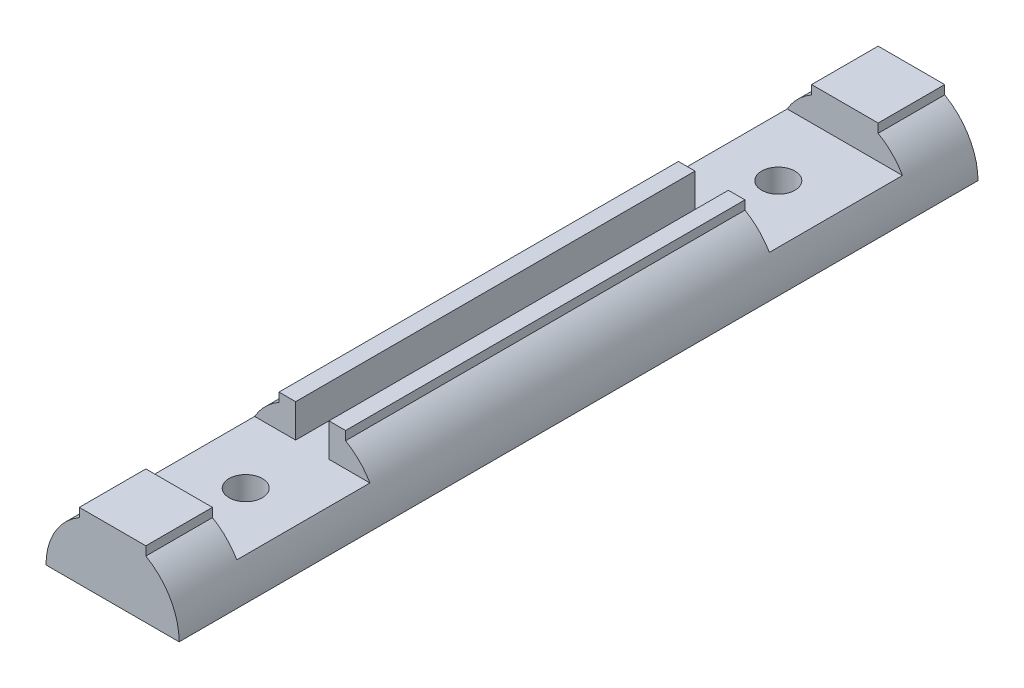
from build123d import *

# Parameters (mm, degrees)
SKETCH1_R           = 10
BOSS_EXTRUDE1_DEPTH = 60
SKETCH2_W           = 10
SKETCH2_H           = 20
BOSS_EXTRUDE2_DEPTH = 120
SKETCH3_W           = 17.320508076
SKETCH3_H           = 5
CUT_EXTRUDE1_DEPTH  = 10
SKETCH4_R           = 2.5
CUT_EXTRUDE3_DEPTH  = 63.649820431
SKETCH5_W           = 5
SKETCH5_H           = 60
CUT_EXTRUDE2_DEPTH  = 5
SKETCH6_W           = 20
SKETCH6_H           = 10
CUT_EXTRUDE4_DEPTH  = 121.830459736


with BuildPart() as part:
    # Sketch1 → Boss-Extrude1 (new, symmetric)
    with BuildSketch(Plane.XY):
        Circle(SKETCH1_R)
    extrude(amount=BOSS_EXTRUDE1_DEPTH, both=True)

    # Sketch2 → Boss-Extrude2 (add)
    with BuildSketch(Plane.XY.offset(60)):
        Rectangle(SKETCH2_W, SKETCH2_H)
    extrude(amount=-BOSS_EXTRUDE2_DEPTH)

    # Sketch3 → Cut-Extrude1 (cut, symmetric)
    with BuildSketch(Plane.XY.offset(-40)):
        with Locations((0, 7.5)):
            Rectangle(SKETCH3_W, SKETCH3_H)
    cut_extrude1 = extrude(amount=CUT_EXTRUDE1_DEPTH, both=True, mode=Mode.SUBTRACT)

    # Sketch4 → Cut-Extrude3 (cut, through all)
    with BuildSketch(Plane(origin=(0, 5, 0), x_dir=(1, 0, 0), z_dir=(0, 1, 0))):
        with Locations(Location((0, 40, 0), (0, 0, 270))):
            Circle(SKETCH4_R)
    cut_extrude3 = extrude(amount=-CUT_EXTRUDE3_DEPTH, mode=Mode.SUBTRACT)

    # Mirror1: Cut-Extrude1, Cut-Extrude3 across plane
    add(cut_extrude1.mirror(Plane.XY), mode=Mode.SUBTRACT)
    add(cut_extrude3.mirror(Plane.XY), mode=Mode.SUBTRACT)

    # Sketch5 → Cut-Extrude2 (cut)
    with BuildSketch(Plane(origin=(0, 10, 0), x_dir=(1, 0, 0), z_dir=(0, 1, 0))):
        Rectangle(SKETCH5_W, SKETCH5_H)
    extrude(amount=-CUT_EXTRUDE2_DEPTH, mode=Mode.SUBTRACT)

    # Sketch6 → Cut-Extrude4 (cut, through all)
    with BuildSketch(Plane.XY.offset(60)):
        with Locations((0, -5)):
            Rectangle(SKETCH6_W, SKETCH6_H)
    extrude(amount=-CUT_EXTRUDE4_DEPTH, mode=Mode.SUBTRACT)


solid = part.part
